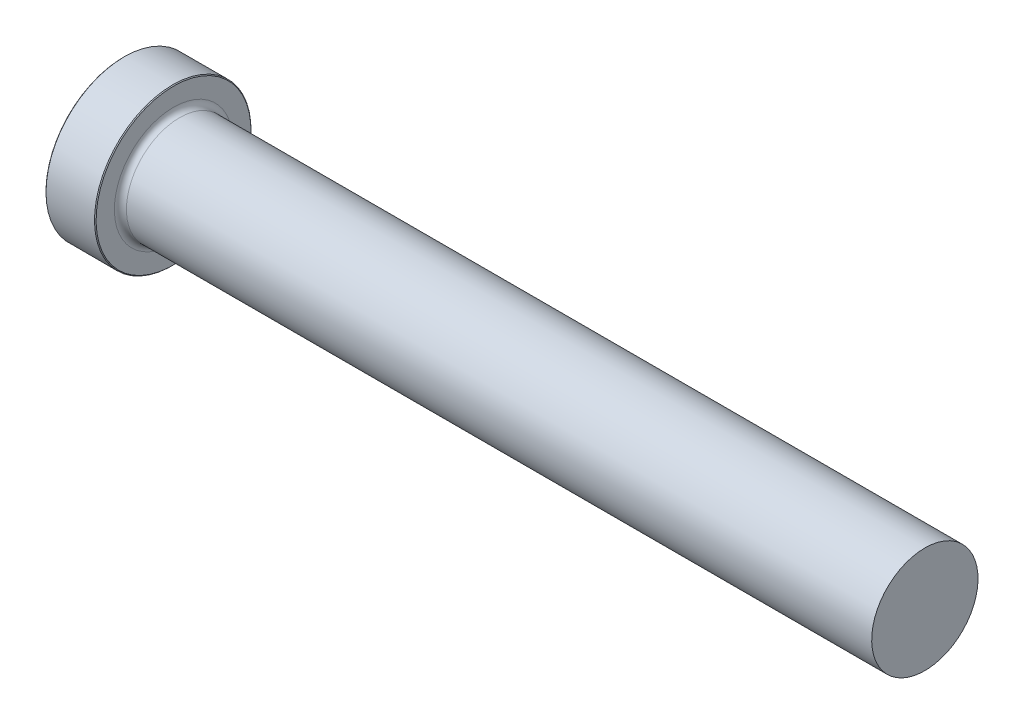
ISO-10303-21;
HEADER;
FILE_DESCRIPTION(('STEP AP214'),'2;1');
FILE_NAME('part.step','',(''),(''),'','','');
FILE_SCHEMA(('AUTOMOTIVE_DESIGN { 1 0 10303 214 1 1 1 1 }'));
ENDSEC;
DATA;
#1=APPLICATION_CONTEXT('core data for automotive mechanical design processes');
#2=APPLICATION_PROTOCOL_DEFINITION('international standard','automotive_design',2000,#1);
#3=PRODUCT_CONTEXT('',#1,'mechanical');
#4=PRODUCT('Part','Part','',(#3));
#5=PRODUCT_RELATED_PRODUCT_CATEGORY('part','',(#4));
#6=PRODUCT_DEFINITION_FORMATION('','',#4);
#7=PRODUCT_DEFINITION_CONTEXT('part definition',#1,'design');
#8=PRODUCT_DEFINITION('design','',#6,#7);
#9=PRODUCT_DEFINITION_SHAPE('','',#8);
#10=(LENGTH_UNIT() NAMED_UNIT(*) SI_UNIT(.MILLI.,.METRE.));
#11=(NAMED_UNIT(*) PLANE_ANGLE_UNIT() SI_UNIT($,.RADIAN.));
#12=(NAMED_UNIT(*) SI_UNIT($,.STERADIAN.) SOLID_ANGLE_UNIT());
#13=UNCERTAINTY_MEASURE_WITH_UNIT(LENGTH_MEASURE(1.E-05),#10,'distance_accuracy_value','');
#14=(GEOMETRIC_REPRESENTATION_CONTEXT(3) GLOBAL_UNCERTAINTY_ASSIGNED_CONTEXT((#13)) GLOBAL_UNIT_ASSIGNED_CONTEXT((#10,
#11,#12)) REPRESENTATION_CONTEXT('',''));
#15=CARTESIAN_POINT('',(0.,0.,0.));
#16=DIRECTION('',(0.,0.,1.));
#17=DIRECTION('',(1.,0.,0.));
#18=AXIS2_PLACEMENT_3D('',#15,#16,#17);
#19=CARTESIAN_POINT('',(101.6,6.74052499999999,0.));
#20=DIRECTION('',(1.,0.,0.));
#21=DIRECTION('',(0.,1.,0.));
#22=AXIS2_PLACEMENT_3D('',#19,#20,#21);
#23=PLANE('',#22);
#24=CARTESIAN_POINT('',(101.6,0.,0.));
#25=DIRECTION('',(1.,0.,0.));
#26=DIRECTION('',(0.,1.,0.));
#27=AXIS2_PLACEMENT_3D('',#24,#25,#26);
#28=CIRCLE('',#27,6.740525);
#29=CARTESIAN_POINT('',(101.6,6.74052499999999,0.));
#30=VERTEX_POINT('',#29);
#31=EDGE_CURVE('E50',#30,#30,#28,.T.);
#32=ORIENTED_EDGE('',*,*,#31,.T.);
#33=EDGE_LOOP('',(#32));
#34=FACE_BOUND('',#33,.T.);
#35=ADVANCED_FACE('F30',(#34),#23,.T.);
#36=CARTESIAN_POINT('',(101.6,0.,0.));
#37=DIRECTION('',(1.,0.,0.));
#38=DIRECTION('',(0.,1.,0.));
#39=AXIS2_PLACEMENT_3D('',#36,#37,#38);
#40=CYLINDRICAL_SURFACE('',#39,6.740525);
#41=CARTESIAN_POINT('',(7.11199999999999,0.,0.));
#42=DIRECTION('',(1.,0.,0.));
#43=DIRECTION('',(0.,1.,0.));
#44=AXIS2_PLACEMENT_3D('',#41,#42,#43);
#45=CIRCLE('',#44,6.740525);
#46=CARTESIAN_POINT('',(7.11199999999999,6.74052499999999,0.));
#47=VERTEX_POINT('',#46);
#48=EDGE_CURVE('E53',#47,#47,#45,.T.);
#49=ORIENTED_EDGE('',*,*,#48,.T.);
#50=EDGE_LOOP('',(#49));
#51=FACE_BOUND('',#50,.T.);
#52=ORIENTED_EDGE('',*,*,#31,.F.);
#53=EDGE_LOOP('',(#52));
#54=FACE_BOUND('',#53,.T.);
#55=ADVANCED_FACE('F74',(#51,#54),#40,.T.);
#56=CARTESIAN_POINT('',(7.112,0.,0.));
#57=DIRECTION('',(1.,0.,0.));
#58=DIRECTION('',(0.,1.,0.));
#59=AXIS2_PLACEMENT_3D('',#56,#57,#58);
#60=TOROIDAL_SURFACE('',#59,7.50252499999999,0.761999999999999);
#61=CARTESIAN_POINT('',(6.34999999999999,0.,0.));
#62=DIRECTION('',(1.,0.,0.));
#63=DIRECTION('',(0.,1.,0.));
#64=AXIS2_PLACEMENT_3D('',#61,#62,#63);
#65=CIRCLE('',#64,7.50252499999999);
#66=CARTESIAN_POINT('',(6.35,7.50252499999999,0.));
#67=VERTEX_POINT('',#66);
#68=EDGE_CURVE('E56',#67,#67,#65,.T.);
#69=ORIENTED_EDGE('',*,*,#68,.T.);
#70=EDGE_LOOP('',(#69));
#71=FACE_BOUND('',#70,.T.);
#72=ORIENTED_EDGE('',*,*,#48,.F.);
#73=EDGE_LOOP('',(#72));
#74=FACE_BOUND('',#73,.T.);
#75=ADVANCED_FACE('F60',(#71,#74),#60,.F.);
#76=CARTESIAN_POINT('',(6.35,9.921875,0.));
#77=DIRECTION('',(1.,0.,0.));
#78=DIRECTION('',(0.,1.,0.));
#79=AXIS2_PLACEMENT_3D('',#76,#77,#78);
#80=PLANE('',#79);
#81=CARTESIAN_POINT('',(6.35,0.,0.));
#82=DIRECTION('',(1.,0.,0.));
#83=DIRECTION('',(0.,1.,0.));
#84=AXIS2_PLACEMENT_3D('',#81,#82,#83);
#85=CIRCLE('',#84,9.820275);
#86=CARTESIAN_POINT('',(6.35,9.820275,0.));
#87=VERTEX_POINT('',#86);
#88=EDGE_CURVE('E10',#87,#87,#85,.T.);
#89=ORIENTED_EDGE('',*,*,#88,.T.);
#90=EDGE_LOOP('',(#89));
#91=FACE_BOUND('',#90,.T.);
#92=ORIENTED_EDGE('',*,*,#68,.F.);
#93=EDGE_LOOP('',(#92));
#94=FACE_BOUND('',#93,.T.);
#95=ADVANCED_FACE('F63',(#91,#94),#80,.T.);
#96=CARTESIAN_POINT('',(101.6,0.,0.));
#97=DIRECTION('',(1.,0.,0.));
#98=DIRECTION('',(0.,1.,0.));
#99=AXIS2_PLACEMENT_3D('',#96,#97,#98);
#100=CYLINDRICAL_SURFACE('',#99,9.921875);
#101=CARTESIAN_POINT('',(0.101599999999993,0.,0.));
#102=DIRECTION('',(-1.,0.,0.));
#103=DIRECTION('',(0.,-1.,0.));
#104=AXIS2_PLACEMENT_3D('',#101,#102,#103);
#105=CIRCLE('',#104,9.921875);
#106=CARTESIAN_POINT('',(0.101599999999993,-9.921875,0.));
#107=VERTEX_POINT('',#106);
#108=EDGE_CURVE('E41',#107,#107,#105,.F.);
#109=ORIENTED_EDGE('',*,*,#108,.T.);
#110=EDGE_LOOP('',(#109));
#111=FACE_BOUND('',#110,.T.);
#112=CARTESIAN_POINT('',(6.24840000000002,0.,0.));
#113=DIRECTION('',(1.,0.,0.));
#114=DIRECTION('',(0.,1.,0.));
#115=AXIS2_PLACEMENT_3D('',#112,#113,#114);
#116=CIRCLE('',#115,9.921875);
#117=CARTESIAN_POINT('',(6.24840000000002,9.921875,0.));
#118=VERTEX_POINT('',#117);
#119=EDGE_CURVE('E45',#118,#118,#116,.F.);
#120=ORIENTED_EDGE('',*,*,#119,.T.);
#121=EDGE_LOOP('',(#120));
#122=FACE_BOUND('',#121,.T.);
#123=ADVANCED_FACE('F65',(#111,#122),#100,.T.);
#124=CARTESIAN_POINT('',(0.,0.,0.));
#125=DIRECTION('',(-1.,0.,0.));
#126=DIRECTION('',(0.,-1.,0.));
#127=AXIS2_PLACEMENT_3D('',#124,#125,#126);
#128=PLANE('',#127);
#129=CARTESIAN_POINT('',(0.,0.,0.));
#130=DIRECTION('',(-1.,0.,0.));
#131=DIRECTION('',(0.,-1.,0.));
#132=AXIS2_PLACEMENT_3D('',#129,#130,#131);
#133=CIRCLE('',#132,9.820275);
#134=CARTESIAN_POINT('',(0.,-9.820275,0.));
#135=VERTEX_POINT('',#134);
#136=EDGE_CURVE('E37',#135,#135,#133,.T.);
#137=ORIENTED_EDGE('',*,*,#136,.T.);
#138=EDGE_LOOP('',(#137));
#139=FACE_BOUND('',#138,.T.);
#140=ADVANCED_FACE('F71',(#139),#128,.T.);
#141=CARTESIAN_POINT('',(0.101599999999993,0.,0.));
#142=DIRECTION('',(1.,0.,0.));
#143=DIRECTION('',(0.,1.,0.));
#144=AXIS2_PLACEMENT_3D('',#141,#142,#143);
#145=CONICAL_SURFACE('',#144,9.921875,0.785398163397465);
#146=ORIENTED_EDGE('',*,*,#136,.F.);
#147=EDGE_LOOP('',(#146));
#148=FACE_BOUND('',#147,.T.);
#149=ORIENTED_EDGE('',*,*,#108,.F.);
#150=EDGE_LOOP('',(#149));
#151=FACE_BOUND('',#150,.T.);
#152=ADVANCED_FACE('F84',(#148,#151),#145,.T.);
#153=CARTESIAN_POINT('',(6.34999999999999,0.,0.));
#154=DIRECTION('',(-1.,0.,0.));
#155=DIRECTION('',(0.,-1.,0.));
#156=AXIS2_PLACEMENT_3D('',#153,#154,#155);
#157=CONICAL_SURFACE('',#156,9.820275,0.785398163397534);
#158=ORIENTED_EDGE('',*,*,#119,.F.);
#159=EDGE_LOOP('',(#158));
#160=FACE_BOUND('',#159,.T.);
#161=ORIENTED_EDGE('',*,*,#88,.F.);
#162=EDGE_LOOP('',(#161));
#163=FACE_BOUND('',#162,.T.);
#164=ADVANCED_FACE('F32',(#160,#163),#157,.T.);
#165=CLOSED_SHELL('',(#35,#55,#75,#95,#123,#140,#152,#164));
#166=MANIFOLD_SOLID_BREP('B2',#165);
#167=ADVANCED_BREP_SHAPE_REPRESENTATION('',(#18,#166),#14);
#168=SHAPE_DEFINITION_REPRESENTATION(#9,#167);
ENDSEC;
END-ISO-10303-21;
